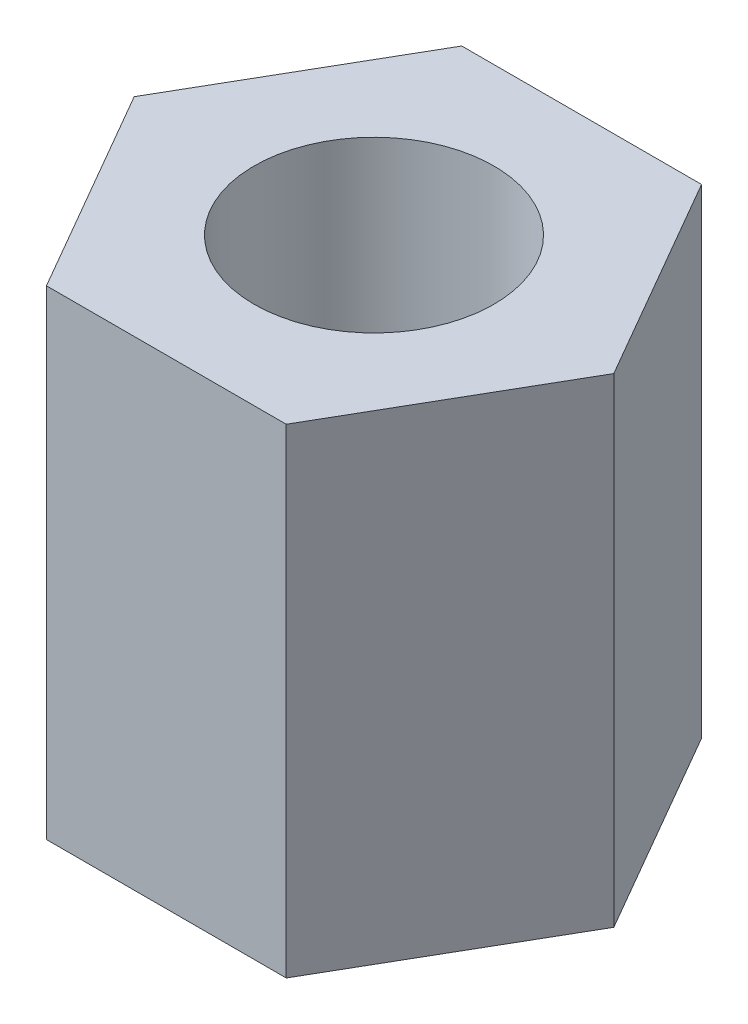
from build123d import *

# Parameters (mm, degrees)
SKETCH1_R      = 2
EXTRUDE1_DEPTH = 8


with BuildPart() as part:
    # Sketch1 → Extrude1 (new body)
    with BuildSketch(Plane(origin=(0, 0, 0), x_dir=(1, 0, 0), z_dir=(0, 1, 0))):
        Polygon((4, 0), (2, 3.464101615), (-2, 3.464101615), (-4, 0), (-2, -3.464101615), (2, -3.464101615), align=None)
        with Locations(Location((0, 0, 0), (0, 0, 270))):
            Circle(SKETCH1_R, mode=Mode.SUBTRACT)
    extrude(amount=EXTRUDE1_DEPTH)


solid = part.part
